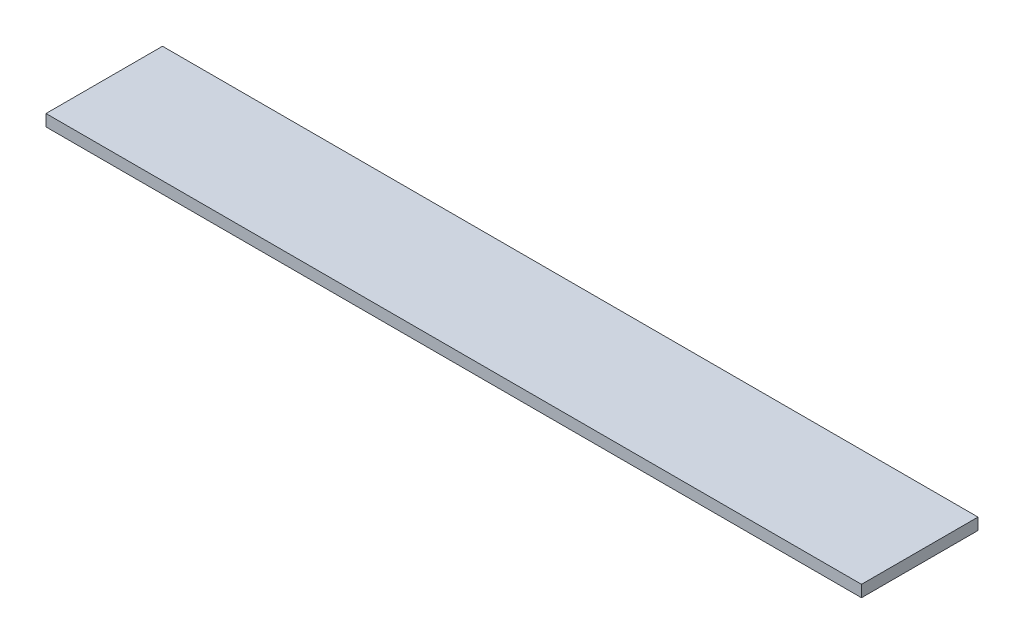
from build123d import *

# Parameters (mm, degrees)
SKETCH1_W      = 7000
SKETCH1_H      = 1000
EXTRUDE1_DEPTH = 100


with BuildPart() as part:
    # Sketch1 → Extrude1 (new body)
    with BuildSketch(Plane(origin=(0, 0, 0), x_dir=(1, 0, 0), z_dir=(0, 1, 0))):
        Rectangle(SKETCH1_W, SKETCH1_H)
    extrude(amount=EXTRUDE1_DEPTH)


solid = part.part
